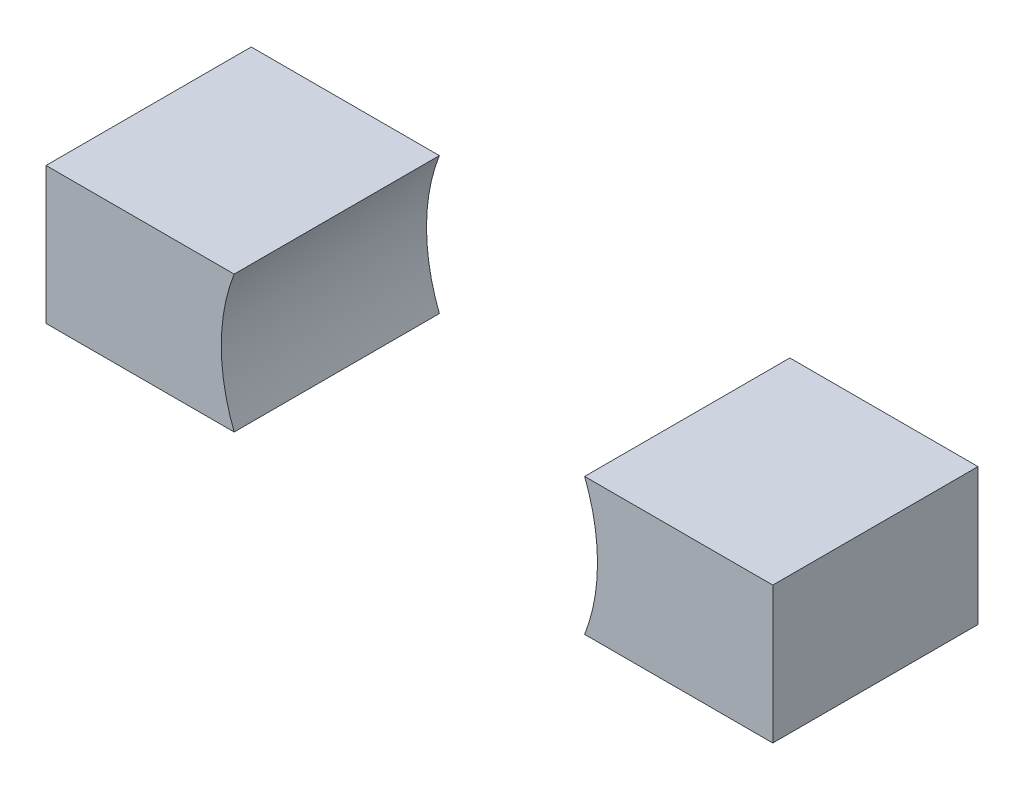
ISO-10303-21;
HEADER;
FILE_DESCRIPTION(('STEP AP214'),'2;1');
FILE_NAME('part.step','',(''),(''),'','','');
FILE_SCHEMA(('AUTOMOTIVE_DESIGN { 1 0 10303 214 1 1 1 1 }'));
ENDSEC;
DATA;
#1=APPLICATION_CONTEXT('core data for automotive mechanical design processes');
#2=APPLICATION_PROTOCOL_DEFINITION('international standard','automotive_design',2000,#1);
#3=PRODUCT_CONTEXT('',#1,'mechanical');
#4=PRODUCT('Part','Part','',(#3));
#5=PRODUCT_RELATED_PRODUCT_CATEGORY('part','',(#4));
#6=PRODUCT_DEFINITION_FORMATION('','',#4);
#7=PRODUCT_DEFINITION_CONTEXT('part definition',#1,'design');
#8=PRODUCT_DEFINITION('design','',#6,#7);
#9=PRODUCT_DEFINITION_SHAPE('','',#8);
#10=(LENGTH_UNIT() NAMED_UNIT(*) SI_UNIT(.MILLI.,.METRE.));
#11=(NAMED_UNIT(*) PLANE_ANGLE_UNIT() SI_UNIT($,.RADIAN.));
#12=(NAMED_UNIT(*) SI_UNIT($,.STERADIAN.) SOLID_ANGLE_UNIT());
#13=UNCERTAINTY_MEASURE_WITH_UNIT(LENGTH_MEASURE(1.E-05),#10,'distance_accuracy_value','');
#14=(GEOMETRIC_REPRESENTATION_CONTEXT(3) GLOBAL_UNCERTAINTY_ASSIGNED_CONTEXT((#13)) GLOBAL_UNIT_ASSIGNED_CONTEXT((#10,
#11,#12)) REPRESENTATION_CONTEXT('',''));
#15=CARTESIAN_POINT('',(0.,0.,0.));
#16=DIRECTION('',(0.,0.,1.));
#17=DIRECTION('',(1.,0.,0.));
#18=AXIS2_PLACEMENT_3D('',#15,#16,#17);
#19=CARTESIAN_POINT('',(0.,8.,12.));
#20=DIRECTION('',(0.,1.,0.));
#21=DIRECTION('',(0.,0.,1.));
#22=AXIS2_PLACEMENT_3D('',#19,#20,#21);
#23=PLANE('',#22);
#24=DIRECTION('',(0.,0.,1.));
#25=VECTOR('',#24,1.);
#26=CARTESIAN_POINT('',(-31.4969507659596,8.,0.));
#27=LINE('',#26,#25);
#28=CARTESIAN_POINT('',(-31.4969507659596,8.,0.));
#29=VERTEX_POINT('',#28);
#30=CARTESIAN_POINT('',(-31.4969507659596,8.,12.));
#31=VERTEX_POINT('',#30);
#32=EDGE_CURVE('E62',#29,#31,#27,.T.);
#33=ORIENTED_EDGE('',*,*,#32,.F.);
#34=DIRECTION('',(1.,0.,0.));
#35=VECTOR('',#34,1.);
#36=CARTESIAN_POINT('',(0.,8.,0.));
#37=LINE('',#36,#35);
#38=CARTESIAN_POINT('',(-42.5,8.,0.));
#39=VERTEX_POINT('',#38);
#40=EDGE_CURVE('E129',#39,#29,#37,.T.);
#41=ORIENTED_EDGE('',*,*,#40,.F.);
#42=DIRECTION('',(0.,0.,-1.));
#43=VECTOR('',#42,1.);
#44=CARTESIAN_POINT('',(-42.5,8.,12.));
#45=LINE('',#44,#43);
#46=CARTESIAN_POINT('',(-42.5,8.,12.));
#47=VERTEX_POINT('',#46);
#48=EDGE_CURVE('E110',#47,#39,#45,.T.);
#49=ORIENTED_EDGE('',*,*,#48,.F.);
#50=DIRECTION('',(1.,0.,0.));
#51=VECTOR('',#50,1.);
#52=CARTESIAN_POINT('',(0.,8.,12.));
#53=LINE('',#52,#51);
#54=EDGE_CURVE('E116',#47,#31,#53,.T.);
#55=ORIENTED_EDGE('',*,*,#54,.T.);
#56=EDGE_LOOP('',(#33,#41,#49,#55));
#57=FACE_BOUND('',#56,.T.);
#58=ADVANCED_FACE('F53',(#57),#23,.T.);
#59=CARTESIAN_POINT('',(0.,0.,12.));
#60=DIRECTION('',(0.,1.,0.));
#61=DIRECTION('',(0.,0.,1.));
#62=AXIS2_PLACEMENT_3D('',#59,#60,#61);
#63=PLANE('',#62);
#64=DIRECTION('',(1.,0.,0.));
#65=VECTOR('',#64,1.);
#66=CARTESIAN_POINT('',(0.,0.,0.));
#67=LINE('',#66,#65);
#68=CARTESIAN_POINT('',(-42.5,0.,0.));
#69=VERTEX_POINT('',#68);
#70=CARTESIAN_POINT('',(-31.4969507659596,0.,0.));
#71=VERTEX_POINT('',#70);
#72=EDGE_CURVE('E120',#69,#71,#67,.T.);
#73=ORIENTED_EDGE('',*,*,#72,.T.);
#74=DIRECTION('',(0.,0.,1.));
#75=VECTOR('',#74,1.);
#76=CARTESIAN_POINT('',(-31.4969507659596,0.,0.));
#77=LINE('',#76,#75);
#78=CARTESIAN_POINT('',(-31.4969507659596,0.,12.));
#79=VERTEX_POINT('',#78);
#80=EDGE_CURVE('E82',#71,#79,#77,.T.);
#81=ORIENTED_EDGE('',*,*,#80,.T.);
#82=DIRECTION('',(1.,0.,0.));
#83=VECTOR('',#82,1.);
#84=CARTESIAN_POINT('',(0.,0.,12.));
#85=LINE('',#84,#83);
#86=CARTESIAN_POINT('',(-42.5,0.,12.));
#87=VERTEX_POINT('',#86);
#88=EDGE_CURVE('E118',#87,#79,#85,.T.);
#89=ORIENTED_EDGE('',*,*,#88,.F.);
#90=DIRECTION('',(0.,0.,-1.));
#91=VECTOR('',#90,1.);
#92=CARTESIAN_POINT('',(-42.5,0.,12.));
#93=LINE('',#92,#91);
#94=EDGE_CURVE('E142',#87,#69,#93,.T.);
#95=ORIENTED_EDGE('',*,*,#94,.T.);
#96=EDGE_LOOP('',(#73,#81,#89,#95));
#97=FACE_BOUND('',#96,.T.);
#98=ADVANCED_FACE('F156',(#97),#63,.F.);
#99=CARTESIAN_POINT('',(0.,0.,12.));
#100=DIRECTION('',(0.,0.,1.));
#101=DIRECTION('',(1.,0.,0.));
#102=AXIS2_PLACEMENT_3D('',#99,#100,#101);
#103=PLANE('',#102);
#104=CARTESIAN_POINT('',(-21.25,4.,12.));
#105=DIRECTION('',(0.,0.,1.));
#106=DIRECTION('',(1.,0.,0.));
#107=AXIS2_PLACEMENT_3D('',#104,#105,#106);
#108=CIRCLE('',#107,11.);
#109=EDGE_CURVE('E12',#31,#79,#108,.T.);
#110=ORIENTED_EDGE('',*,*,#109,.F.);
#111=ORIENTED_EDGE('',*,*,#54,.F.);
#112=DIRECTION('',(0.,-1.,0.));
#113=VECTOR('',#112,1.);
#114=CARTESIAN_POINT('',(-42.5,0.,12.));
#115=LINE('',#114,#113);
#116=EDGE_CURVE('E138',#47,#87,#115,.T.);
#117=ORIENTED_EDGE('',*,*,#116,.T.);
#118=ORIENTED_EDGE('',*,*,#88,.T.);
#119=EDGE_LOOP('',(#110,#111,#117,#118));
#120=FACE_BOUND('',#119,.T.);
#121=ADVANCED_FACE('F115',(#120),#103,.T.);
#122=CARTESIAN_POINT('',(0.,0.,0.));
#123=DIRECTION('',(0.,0.,1.));
#124=DIRECTION('',(1.,0.,0.));
#125=AXIS2_PLACEMENT_3D('',#122,#123,#124);
#126=PLANE('',#125);
#127=ORIENTED_EDGE('',*,*,#40,.T.);
#128=CARTESIAN_POINT('',(-21.25,4.,0.));
#129=DIRECTION('',(0.,0.,1.));
#130=DIRECTION('',(1.,0.,0.));
#131=AXIS2_PLACEMENT_3D('',#128,#129,#130);
#132=CIRCLE('',#131,11.);
#133=EDGE_CURVE('E74',#29,#71,#132,.T.);
#134=ORIENTED_EDGE('',*,*,#133,.T.);
#135=ORIENTED_EDGE('',*,*,#72,.F.);
#136=DIRECTION('',(0.,-1.,0.));
#137=VECTOR('',#136,1.);
#138=CARTESIAN_POINT('',(-42.5,0.,0.));
#139=LINE('',#138,#137);
#140=EDGE_CURVE('E137',#39,#69,#139,.T.);
#141=ORIENTED_EDGE('',*,*,#140,.F.);
#142=EDGE_LOOP('',(#127,#134,#135,#141));
#143=FACE_BOUND('',#142,.T.);
#144=ADVANCED_FACE('F158',(#143),#126,.F.);
#145=CARTESIAN_POINT('',(-42.5,0.,12.));
#146=DIRECTION('',(1.,0.,0.));
#147=DIRECTION('',(0.,0.,-1.));
#148=AXIS2_PLACEMENT_3D('',#145,#146,#147);
#149=PLANE('',#148);
#150=ORIENTED_EDGE('',*,*,#140,.T.);
#151=ORIENTED_EDGE('',*,*,#94,.F.);
#152=ORIENTED_EDGE('',*,*,#116,.F.);
#153=ORIENTED_EDGE('',*,*,#48,.T.);
#154=EDGE_LOOP('',(#150,#151,#152,#153));
#155=FACE_BOUND('',#154,.T.);
#156=ADVANCED_FACE('F167',(#155),#149,.F.);
#157=CARTESIAN_POINT('',(-21.25,4.,0.));
#158=DIRECTION('',(0.,0.,1.));
#159=DIRECTION('',(1.,0.,0.));
#160=AXIS2_PLACEMENT_3D('',#157,#158,#159);
#161=CYLINDRICAL_SURFACE('',#160,11.);
#162=ORIENTED_EDGE('',*,*,#32,.T.);
#163=ORIENTED_EDGE('',*,*,#109,.T.);
#164=ORIENTED_EDGE('',*,*,#80,.F.);
#165=ORIENTED_EDGE('',*,*,#133,.F.);
#166=EDGE_LOOP('',(#162,#163,#164,#165));
#167=FACE_BOUND('',#166,.T.);
#168=ADVANCED_FACE('F55',(#167),#161,.F.);
#169=CLOSED_SHELL('',(#58,#98,#121,#144,#156,#168));
#170=MANIFOLD_SOLID_BREP('B2',#169);
#171=CARTESIAN_POINT('',(0.,0.,12.));
#172=DIRECTION('',(1.,0.,0.));
#173=DIRECTION('',(0.,1.,0.));
#174=AXIS2_PLACEMENT_3D('',#171,#172,#173);
#175=PLANE('',#174);
#176=DIRECTION('',(0.,-1.,0.));
#177=VECTOR('',#176,1.);
#178=CARTESIAN_POINT('',(0.,0.,0.));
#179=LINE('',#178,#177);
#180=CARTESIAN_POINT('',(0.,8.,0.));
#181=VERTEX_POINT('',#180);
#182=CARTESIAN_POINT('',(0.,0.,0.));
#183=VERTEX_POINT('',#182);
#184=EDGE_CURVE('E327',#181,#183,#179,.T.);
#185=ORIENTED_EDGE('',*,*,#184,.F.);
#186=DIRECTION('',(0.,0.,-1.));
#187=VECTOR('',#186,1.);
#188=CARTESIAN_POINT('',(0.,8.,12.));
#189=LINE('',#188,#187);
#190=CARTESIAN_POINT('',(0.,8.,12.));
#191=VERTEX_POINT('',#190);
#192=EDGE_CURVE('E269',#191,#181,#189,.T.);
#193=ORIENTED_EDGE('',*,*,#192,.F.);
#194=DIRECTION('',(0.,-1.,0.));
#195=VECTOR('',#194,1.);
#196=CARTESIAN_POINT('',(0.,0.,12.));
#197=LINE('',#196,#195);
#198=CARTESIAN_POINT('',(0.,0.,12.));
#199=VERTEX_POINT('',#198);
#200=EDGE_CURVE('E321',#191,#199,#197,.T.);
#201=ORIENTED_EDGE('',*,*,#200,.T.);
#202=DIRECTION('',(0.,0.,-1.));
#203=VECTOR('',#202,1.);
#204=CARTESIAN_POINT('',(0.,0.,12.));
#205=LINE('',#204,#203);
#206=EDGE_CURVE('E313',#199,#183,#205,.T.);
#207=ORIENTED_EDGE('',*,*,#206,.T.);
#208=EDGE_LOOP('',(#185,#193,#201,#207));
#209=FACE_BOUND('',#208,.T.);
#210=ADVANCED_FACE('F261',(#209),#175,.T.);
#211=CARTESIAN_POINT('',(0.,0.,0.));
#212=DIRECTION('',(0.,0.,1.));
#213=DIRECTION('',(1.,0.,0.));
#214=AXIS2_PLACEMENT_3D('',#211,#212,#213);
#215=PLANE('',#214);
#216=DIRECTION('',(1.,0.,0.));
#217=VECTOR('',#216,1.);
#218=CARTESIAN_POINT('',(0.,0.,0.));
#219=LINE('',#218,#217);
#220=CARTESIAN_POINT('',(-11.0030492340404,0.,0.));
#221=VERTEX_POINT('',#220);
#222=EDGE_CURVE('E310',#221,#183,#219,.T.);
#223=ORIENTED_EDGE('',*,*,#222,.F.);
#224=CARTESIAN_POINT('',(-21.25,4.,0.));
#225=DIRECTION('',(0.,0.,1.));
#226=DIRECTION('',(1.,0.,0.));
#227=AXIS2_PLACEMENT_3D('',#224,#225,#226);
#228=CIRCLE('',#227,11.);
#229=CARTESIAN_POINT('',(-11.0030492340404,8.,0.));
#230=VERTEX_POINT('',#229);
#231=EDGE_CURVE('E51',#221,#230,#228,.T.);
#232=ORIENTED_EDGE('',*,*,#231,.T.);
#233=DIRECTION('',(1.,0.,0.));
#234=VECTOR('',#233,1.);
#235=CARTESIAN_POINT('',(0.,8.,0.));
#236=LINE('',#235,#234);
#237=EDGE_CURVE('E322',#230,#181,#236,.T.);
#238=ORIENTED_EDGE('',*,*,#237,.T.);
#239=ORIENTED_EDGE('',*,*,#184,.T.);
#240=EDGE_LOOP('',(#223,#232,#238,#239));
#241=FACE_BOUND('',#240,.T.);
#242=ADVANCED_FACE('F330',(#241),#215,.F.);
#243=CARTESIAN_POINT('',(0.,0.,12.));
#244=DIRECTION('',(0.,0.,1.));
#245=DIRECTION('',(1.,0.,0.));
#246=AXIS2_PLACEMENT_3D('',#243,#244,#245);
#247=PLANE('',#246);
#248=CARTESIAN_POINT('',(-21.25,4.,12.));
#249=DIRECTION('',(0.,0.,1.));
#250=DIRECTION('',(1.,0.,0.));
#251=AXIS2_PLACEMENT_3D('',#248,#249,#250);
#252=CIRCLE('',#251,11.);
#253=CARTESIAN_POINT('',(-11.0030492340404,0.,12.));
#254=VERTEX_POINT('',#253);
#255=CARTESIAN_POINT('',(-11.0030492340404,8.,12.));
#256=VERTEX_POINT('',#255);
#257=EDGE_CURVE('E360',#254,#256,#252,.T.);
#258=ORIENTED_EDGE('',*,*,#257,.F.);
#259=DIRECTION('',(1.,0.,0.));
#260=VECTOR('',#259,1.);
#261=CARTESIAN_POINT('',(0.,0.,12.));
#262=LINE('',#261,#260);
#263=EDGE_CURVE('E292',#254,#199,#262,.T.);
#264=ORIENTED_EDGE('',*,*,#263,.T.);
#265=ORIENTED_EDGE('',*,*,#200,.F.);
#266=DIRECTION('',(1.,0.,0.));
#267=VECTOR('',#266,1.);
#268=CARTESIAN_POINT('',(0.,8.,12.));
#269=LINE('',#268,#267);
#270=EDGE_CURVE('E349',#256,#191,#269,.T.);
#271=ORIENTED_EDGE('',*,*,#270,.F.);
#272=EDGE_LOOP('',(#258,#264,#265,#271));
#273=FACE_BOUND('',#272,.T.);
#274=ADVANCED_FACE('F350',(#273),#247,.T.);
#275=CARTESIAN_POINT('',(0.,0.,12.));
#276=DIRECTION('',(0.,1.,0.));
#277=DIRECTION('',(0.,0.,1.));
#278=AXIS2_PLACEMENT_3D('',#275,#276,#277);
#279=PLANE('',#278);
#280=ORIENTED_EDGE('',*,*,#263,.F.);
#281=DIRECTION('',(0.,0.,1.));
#282=VECTOR('',#281,1.);
#283=CARTESIAN_POINT('',(-11.0030492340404,0.,0.));
#284=LINE('',#283,#282);
#285=EDGE_CURVE('E317',#254,#221,#284,.F.);
#286=ORIENTED_EDGE('',*,*,#285,.T.);
#287=ORIENTED_EDGE('',*,*,#222,.T.);
#288=ORIENTED_EDGE('',*,*,#206,.F.);
#289=EDGE_LOOP('',(#280,#286,#287,#288));
#290=FACE_BOUND('',#289,.T.);
#291=ADVANCED_FACE('F312',(#290),#279,.F.);
#292=CARTESIAN_POINT('',(0.,8.,12.));
#293=DIRECTION('',(0.,1.,0.));
#294=DIRECTION('',(0.,0.,1.));
#295=AXIS2_PLACEMENT_3D('',#292,#293,#294);
#296=PLANE('',#295);
#297=DIRECTION('',(0.,0.,1.));
#298=VECTOR('',#297,1.);
#299=CARTESIAN_POINT('',(-11.0030492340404,8.,0.));
#300=LINE('',#299,#298);
#301=EDGE_CURVE('E281',#256,#230,#300,.F.);
#302=ORIENTED_EDGE('',*,*,#301,.F.);
#303=ORIENTED_EDGE('',*,*,#270,.T.);
#304=ORIENTED_EDGE('',*,*,#192,.T.);
#305=ORIENTED_EDGE('',*,*,#237,.F.);
#306=EDGE_LOOP('',(#302,#303,#304,#305));
#307=FACE_BOUND('',#306,.T.);
#308=ADVANCED_FACE('F347',(#307),#296,.T.);
#309=CARTESIAN_POINT('',(-21.25,4.,0.));
#310=DIRECTION('',(0.,0.,1.));
#311=DIRECTION('',(1.,0.,0.));
#312=AXIS2_PLACEMENT_3D('',#309,#310,#311);
#313=CYLINDRICAL_SURFACE('',#312,11.);
#314=ORIENTED_EDGE('',*,*,#301,.T.);
#315=ORIENTED_EDGE('',*,*,#231,.F.);
#316=ORIENTED_EDGE('',*,*,#285,.F.);
#317=ORIENTED_EDGE('',*,*,#257,.T.);
#318=EDGE_LOOP('',(#314,#315,#316,#317));
#319=FACE_BOUND('',#318,.T.);
#320=ADVANCED_FACE('F363',(#319),#313,.F.);
#321=CLOSED_SHELL('',(#210,#242,#274,#291,#308,#320));
#322=MANIFOLD_SOLID_BREP('B6',#321);
#323=ADVANCED_BREP_SHAPE_REPRESENTATION('',(#18,#170,#322),#14);
#324=SHAPE_DEFINITION_REPRESENTATION(#9,#323);
ENDSEC;
END-ISO-10303-21;
